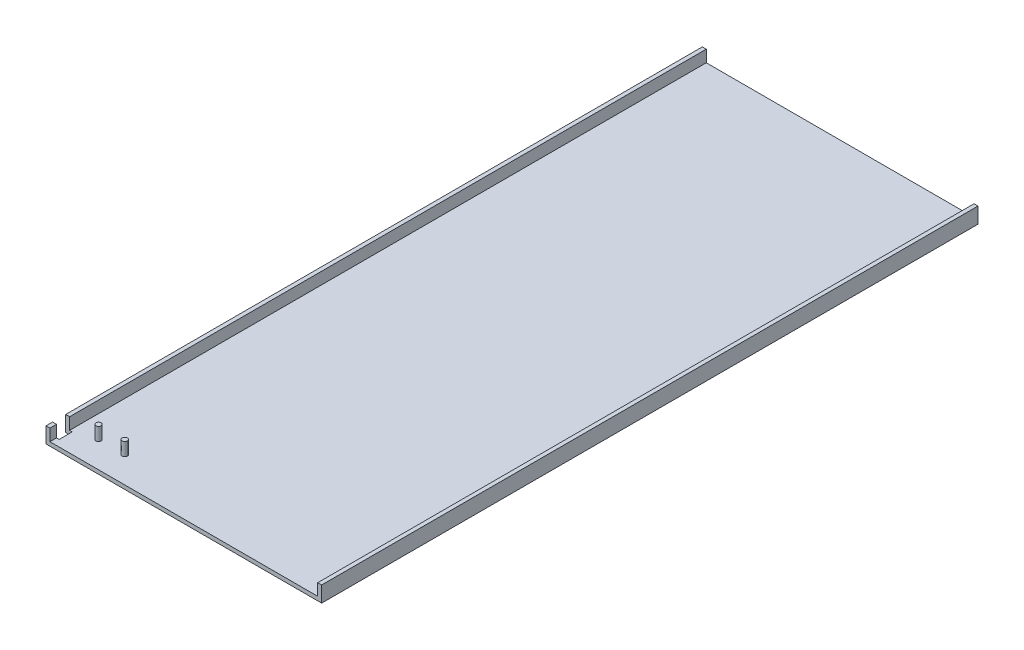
from build123d import *

# Parameters (mm, degrees)
LINEAR_AUSTRAGEN_D_NN1_DEPTH    = 500
SKIZZE2_R                       = 2
AUFSATZ_LINEAR_AUSTRAGEN1_DEPTH = 10
SKIZZE3_W                       = 10
SKIZZE3_H                       = 12
SCHNITT_LINEAR_AUSTRAGEN1_DEPTH = 5


with BuildPart() as part:
    # Skizze1 → Linear-Austragen-D_nn1 (new body)
    with BuildSketch(Plane.XY):
        Polygon((0, 12), (0, 0), (210, 0), (210, 12), (207, 12), (207, 3), (3, 3), (3, 12), align=None)
    extrude(amount=LINEAR_AUSTRAGEN_D_NN1_DEPTH)

    # Skizze2 → Aufsatz-Linear austragen1 (add)
    with BuildSketch(Plane(origin=(0, 3, 0), x_dir=(1, 0, 0), z_dir=(0, 1, 0))):
        with Locations(Location((20, -480, 0), (0, 0, 270))):
            Circle(SKIZZE2_R)
        with Locations(Location((40, -480, 0), (0, 0, 270))):
            Circle(SKIZZE2_R)
    extrude(amount=AUFSATZ_LINEAR_AUSTRAGEN1_DEPTH)

    # Skizze3 → Schnitt-Linear austragen1 (cut)
    with BuildSketch(Plane.ZY):
        with Locations((490, 6)):
            Rectangle(SKIZZE3_W, SKIZZE3_H)
    extrude(amount=-SCHNITT_LINEAR_AUSTRAGEN1_DEPTH, mode=Mode.SUBTRACT)


solid = part.part
